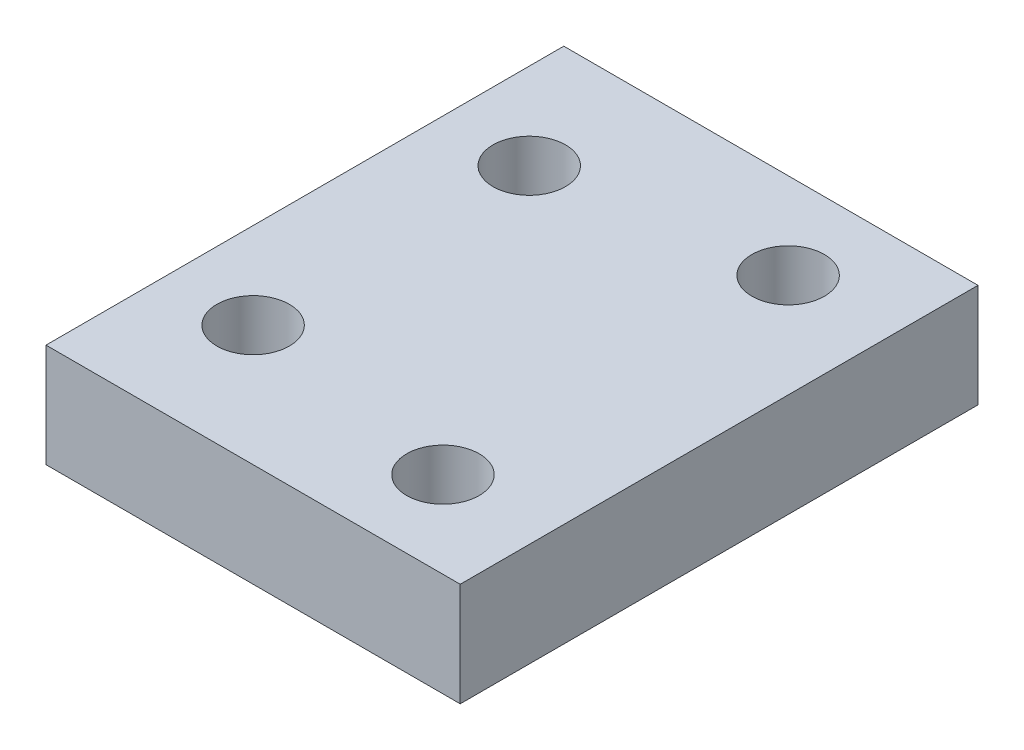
from build123d import *

# Parameters (mm, degrees)
SKETCH_1_W      = 24
SKETCH_1_H      = 30
SKETCH_1_R      = 2.1
EXTRUDE_1_DEPTH = 6


with BuildPart() as part:
    # Sketch 1 → Extrude 1 (new body)
    with BuildSketch(Plane(origin=(0, 0, 0), x_dir=(1, 0, 0), z_dir=(0, 1, 0))):
        with Locations((-12, -15)):
            Rectangle(SKETCH_1_W, SKETCH_1_H)
        with Locations(Location((-6, -25, 0), (0, 0, 270))):
            Circle(SKETCH_1_R, mode=Mode.SUBTRACT)
        with Locations(Location((-6, -5, 0), (0, 0, 270))):
            Circle(SKETCH_1_R, mode=Mode.SUBTRACT)
        with Locations(Location((-19, -7, 0), (0, 0, 270))):
            Circle(SKETCH_1_R, mode=Mode.SUBTRACT)
        with Locations(Location((-19, -23, 0), (0, 0, 270))):
            Circle(SKETCH_1_R, mode=Mode.SUBTRACT)
    extrude(amount=EXTRUDE_1_DEPTH)


solid = part.part
